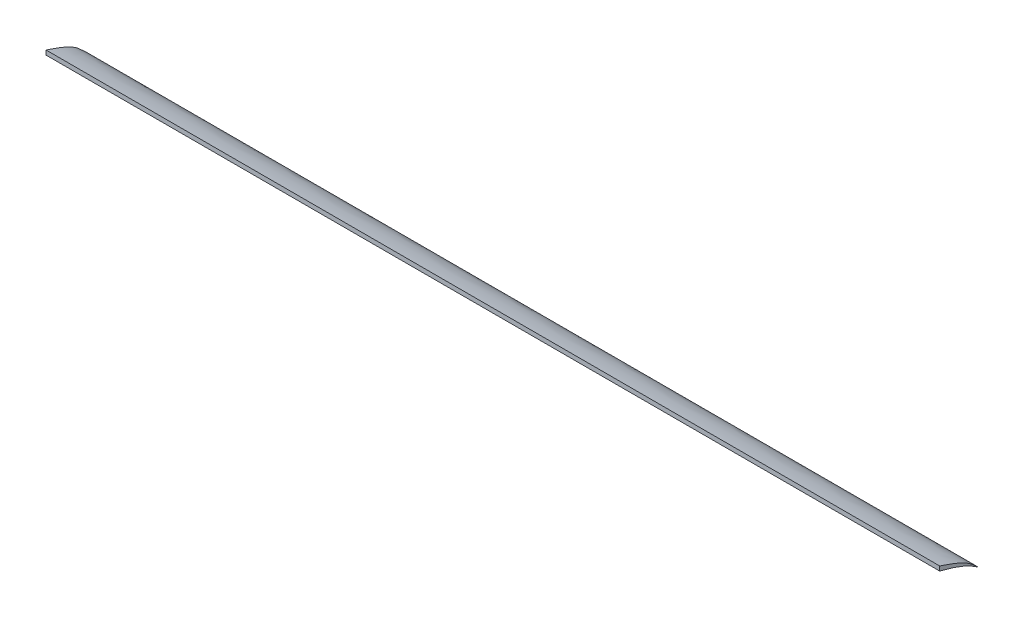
from build123d import *

# Parameters (mm, degrees)
BOSS_EXTRUDE1_DEPTH = 147.6375


with BuildPart() as part:
    # Sketch1 → Boss-Extrude1 (new, symmetric)
    with BuildSketch(Plane(origin=(0, 0, 0), x_dir=(0, 0, -1), z_dir=(1, 0, 0))):
        with BuildLine():
            Line((133.35, 5.195482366), (133.35, 6.663698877))
            add(Edge.make_bspline(
                [(133.35, 5.195482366), (133.673348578, 5.11582965), (135.277577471, 4.710374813), (137.924684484, 3.951887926), (141.021260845, 2.79506562), (143.230508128, 1.736640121), (144.859258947, 0.758126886), (145.484954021, 0.379459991), (146.04910659, -0.003793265), (146.049999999, -3.5e-08), (146.050875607, 0.003717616), (145.570888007, 0.361598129), (145.164984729, 0.760133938), (144.263697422, 1.592572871), (143.200355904, 2.478164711), (141.745686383, 3.371071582), (139.93670947, 4.236536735), (137.752799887, 5.139856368), (135.514663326, 5.953134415), (134.002837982, 6.454480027), (133.35, 6.663698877)],
                knots=[0.95490306, 0.95490306, 0.95490306, 0.95490306, 0.95816921, 0.971135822, 0.981955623, 0.990251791, 0.995852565, 0.999000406, 1, 1, 1, 1.000979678, 1.003648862, 1.007483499, 1.012095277, 1.017525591, 1.02405178, 1.031783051, 1.040677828, 1.047399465, 1.047399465, 1.047399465, 1.047399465], degree=3))
        make_face()
    extrude(amount=BOSS_EXTRUDE1_DEPTH, both=True)


solid = part.part
